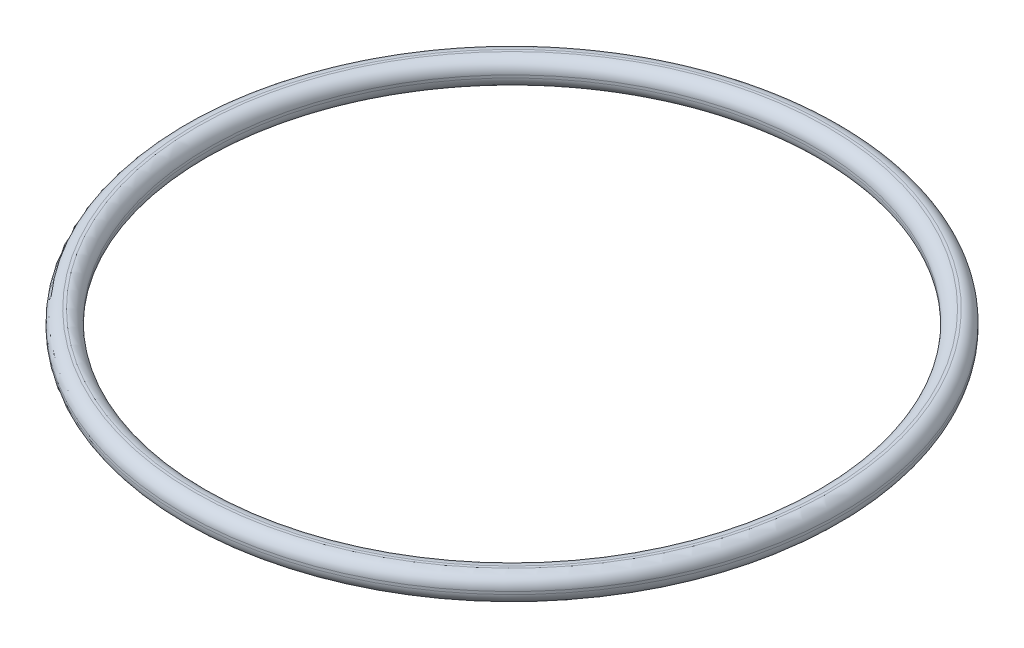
from build123d import *

# Parameters (mm, degrees)
SKETCH1_R           = 12.5
SKETCH1_R_2         = 11.5
BOSS_EXTRUDE1_DEPTH = 1
FILLET1_R           = 0.45


with BuildPart() as part:
    # Sketch1 → Boss-Extrude1 (new body)
    with BuildSketch(Plane(origin=(0, 0, 0), x_dir=(1, 0, 0), z_dir=(0, 1, 0))):
        with Locations(Location((0, 0, 0), (0, 0, 270))):
            Circle(SKETCH1_R)
        with Locations(Location((0, 0, 0), (0, 0, 270))):
            Circle(SKETCH1_R_2, mode=Mode.SUBTRACT)
    extrude(amount=BOSS_EXTRUDE1_DEPTH)

    # Fillet1
    fillet1_edges = [part.edges().sort_by_distance(p)[0] for p in [
        (0, 0, -12.5),
        (0, 1, -12.5),
        (0, 0, -11.5),
        (0, 1, -11.5),
    ]]
    fillet(fillet1_edges, radius=FILLET1_R)


solid = part.part
